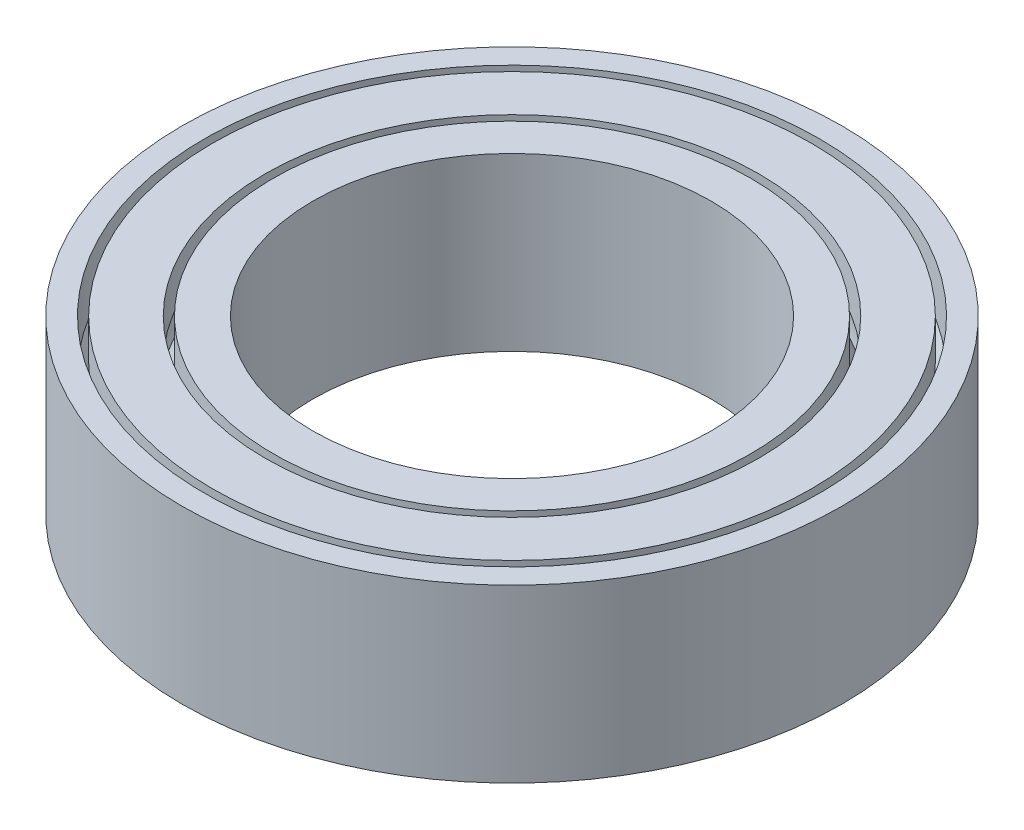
from build123d import *


with BuildPart() as part:
    # Sketch2 → Revolve1 (revolve)
    with BuildSketch(Plane.XY, mode=Mode.PRIVATE) as revolve1_sk:
        with BuildLine():
            Line((9.05, -1.322875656), (9.05, -3.25))
            Line((9.05, -3.25), (7.55, -3.25))
            Line((7.55, -3.25), (7.55, 3.25))
            Line((7.55, 3.25), (9.05, 3.25))
            Line((9.05, 3.25), (9.05, 1.322875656))
            ThreePointArc((9.05, 1.322875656), (9.55, 0), (9.05, -1.322875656))
        make_face()
    revolve(revolve1_sk.sketch.rotate(Axis((0, 0, 0), (0, 1, 0)), 90), axis=Axis((0, 0, 0), (0, 1, 0)))


with BuildPart() as body_2:
    # Sketch3 → Revolve3 (revolve)
    with BuildSketch(Plane.XY, mode=Mode.PRIVATE) as revolve3_sk:
        with BuildLine():
            Line((9.425, 1.653594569), (9.35, 1.738636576))
            Line((9.35, 1.738636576), (9.35, 3.25))
            Line((9.35, 3.25), (11.35, 3.25))
            Line((11.35, 3.25), (11.35, 1.738636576))
            Line((11.35, 1.738636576), (11.275, 1.653594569))
            ThreePointArc((11.275, 1.653594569), (10.65, 0), (11.275, -1.653594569))
            Line((11.275, -1.653594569), (11.35, -1.738636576))
            Line((11.35, -1.738636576), (11.35, -3.25))
            Line((11.35, -3.25), (9.35, -3.25))
            Line((9.35, -3.25), (9.35, -1.738636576))
            Line((9.35, -1.738636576), (9.425, -1.653594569))
            ThreePointArc((9.425, -1.653594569), (10.05, 0), (9.425, 1.653594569))
        make_face()
    revolve(revolve3_sk.sketch.rotate(Axis((0, 0, 0), (0, 1, 0)), 90), axis=Axis((0, 0, 0), (0, 1, 0)))


with BuildPart() as body_3:
    # Sketch5 → Revolve4 (revolve)
    with BuildSketch(Plane.XY, mode=Mode.PRIVATE) as revolve4_sk:
        with BuildLine():
            Line((11.65, 1.322875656), (11.65, 3.25))
            Line((11.65, 3.25), (12.5, 3.25))
            Line((12.5, 3.25), (12.5, -3.25))
            Line((12.5, -3.25), (11.65, -3.25))
            Line((11.65, -3.25), (11.65, -1.322875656))
            ThreePointArc((11.65, -1.322875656), (11.15, 0), (11.65, 1.322875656))
        make_face()
    revolve(revolve4_sk.sketch.rotate(Axis((0, 0, 0), (0, 1, 0)), 90), axis=Axis((0, 0, 0), (0, 1, 0)))


solid = Compound([part.part, body_2.part, body_3.part])
